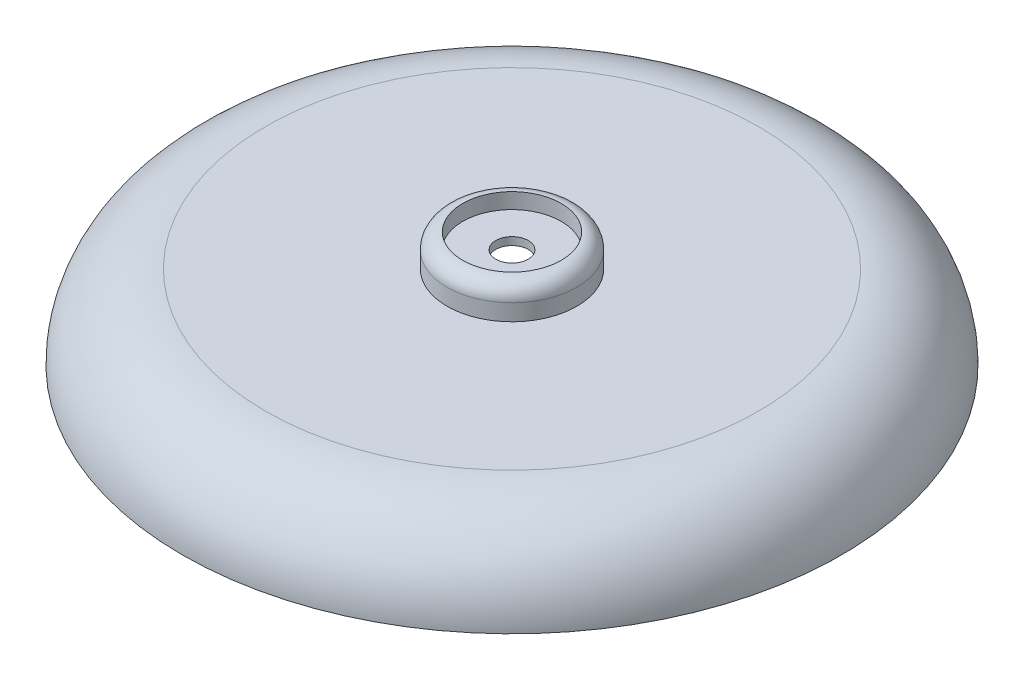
ISO-10303-21;
HEADER;
FILE_DESCRIPTION(('STEP AP214'),'2;1');
FILE_NAME('part.step','',(''),(''),'','','');
FILE_SCHEMA(('AUTOMOTIVE_DESIGN { 1 0 10303 214 1 1 1 1 }'));
ENDSEC;
DATA;
#1=APPLICATION_CONTEXT('core data for automotive mechanical design processes');
#2=APPLICATION_PROTOCOL_DEFINITION('international standard','automotive_design',2000,#1);
#3=PRODUCT_CONTEXT('',#1,'mechanical');
#4=PRODUCT('Part','Part','',(#3));
#5=PRODUCT_RELATED_PRODUCT_CATEGORY('part','',(#4));
#6=PRODUCT_DEFINITION_FORMATION('','',#4);
#7=PRODUCT_DEFINITION_CONTEXT('part definition',#1,'design');
#8=PRODUCT_DEFINITION('design','',#6,#7);
#9=PRODUCT_DEFINITION_SHAPE('','',#8);
#10=(LENGTH_UNIT() NAMED_UNIT(*) SI_UNIT(.MILLI.,.METRE.));
#11=(NAMED_UNIT(*) PLANE_ANGLE_UNIT() SI_UNIT($,.RADIAN.));
#12=(NAMED_UNIT(*) SI_UNIT($,.STERADIAN.) SOLID_ANGLE_UNIT());
#13=UNCERTAINTY_MEASURE_WITH_UNIT(LENGTH_MEASURE(1.E-05),#10,'distance_accuracy_value','');
#14=(GEOMETRIC_REPRESENTATION_CONTEXT(3) GLOBAL_UNCERTAINTY_ASSIGNED_CONTEXT((#13)) GLOBAL_UNIT_ASSIGNED_CONTEXT((#10,
#11,#12)) REPRESENTATION_CONTEXT('',''));
#15=CARTESIAN_POINT('',(0.,0.,0.));
#16=DIRECTION('',(0.,0.,1.));
#17=DIRECTION('',(1.,0.,0.));
#18=AXIS2_PLACEMENT_3D('',#15,#16,#17);
#19=CARTESIAN_POINT('',(0.,0.,0.));
#20=DIRECTION('',(0.,-1.,0.));
#21=DIRECTION('',(0.,0.,-1.));
#22=AXIS2_PLACEMENT_3D('',#19,#20,#21);
#23=CYLINDRICAL_SURFACE('',#22,3.125);
#24=CARTESIAN_POINT('',(0.,-1.5,0.));
#25=DIRECTION('',(0.,-1.,0.));
#26=DIRECTION('',(0.,0.,-1.));
#27=AXIS2_PLACEMENT_3D('',#24,#25,#26);
#28=CIRCLE('',#27,3.125);
#29=CARTESIAN_POINT('',(0.,-1.5,-3.125));
#30=VERTEX_POINT('',#29);
#31=EDGE_CURVE('E72',#30,#30,#28,.T.);
#32=ORIENTED_EDGE('',*,*,#31,.T.);
#33=EDGE_LOOP('',(#32));
#34=FACE_BOUND('',#33,.T.);
#35=CARTESIAN_POINT('',(0.,0.,0.));
#36=DIRECTION('',(0.,-1.,0.));
#37=DIRECTION('',(0.,0.,-1.));
#38=AXIS2_PLACEMENT_3D('',#35,#36,#37);
#39=CIRCLE('',#38,3.125);
#40=CARTESIAN_POINT('',(0.,0.,-3.125));
#41=VERTEX_POINT('',#40);
#42=EDGE_CURVE('E10',#41,#41,#39,.T.);
#43=ORIENTED_EDGE('',*,*,#42,.F.);
#44=EDGE_LOOP('',(#43));
#45=FACE_BOUND('',#44,.T.);
#46=ADVANCED_FACE('F32',(#34,#45),#23,.F.);
#47=CARTESIAN_POINT('',(3.125,0.,0.));
#48=DIRECTION('',(0.,1.,0.));
#49=DIRECTION('',(0.,0.,1.));
#50=AXIS2_PLACEMENT_3D('',#47,#48,#49);
#51=PLANE('',#50);
#52=ORIENTED_EDGE('',*,*,#42,.T.);
#53=EDGE_LOOP('',(#52));
#54=FACE_BOUND('',#53,.T.);
#55=CARTESIAN_POINT('',(0.,0.,0.));
#56=DIRECTION('',(0.,-1.,0.));
#57=DIRECTION('',(0.,0.,-1.));
#58=AXIS2_PLACEMENT_3D('',#55,#56,#57);
#59=CIRCLE('',#58,9.5);
#60=CARTESIAN_POINT('',(0.,0.,-9.5));
#61=VERTEX_POINT('',#60);
#62=EDGE_CURVE('E38',#61,#61,#59,.T.);
#63=ORIENTED_EDGE('',*,*,#62,.F.);
#64=EDGE_LOOP('',(#63));
#65=FACE_BOUND('',#64,.T.);
#66=ADVANCED_FACE('F90',(#54,#65),#51,.T.);
#67=CARTESIAN_POINT('',(0.,0.,0.));
#68=DIRECTION('',(0.,-1.,0.));
#69=DIRECTION('',(0.,0.,-1.));
#70=AXIS2_PLACEMENT_3D('',#67,#68,#69);
#71=CYLINDRICAL_SURFACE('',#70,9.5);
#72=ORIENTED_EDGE('',*,*,#62,.T.);
#73=EDGE_LOOP('',(#72));
#74=FACE_BOUND('',#73,.T.);
#75=CARTESIAN_POINT('',(0.,3.,0.));
#76=DIRECTION('',(0.,-1.,0.));
#77=DIRECTION('',(0.,0.,-1.));
#78=AXIS2_PLACEMENT_3D('',#75,#76,#77);
#79=CIRCLE('',#78,9.5);
#80=CARTESIAN_POINT('',(0.,3.,-9.5));
#81=VERTEX_POINT('',#80);
#82=EDGE_CURVE('E42',#81,#81,#79,.T.);
#83=ORIENTED_EDGE('',*,*,#82,.F.);
#84=EDGE_LOOP('',(#83));
#85=FACE_BOUND('',#84,.T.);
#86=ADVANCED_FACE('F94',(#74,#85),#71,.F.);
#87=CARTESIAN_POINT('',(0.,0.,0.));
#88=DIRECTION('',(0.,-1.,0.));
#89=DIRECTION('',(0.,0.,-1.));
#90=AXIS2_PLACEMENT_3D('',#87,#88,#89);
#91=TOROIDAL_SURFACE('',#90,9.5,3.);
#92=ORIENTED_EDGE('',*,*,#82,.T.);
#93=EDGE_LOOP('',(#92));
#94=FACE_BOUND('',#93,.T.);
#95=CARTESIAN_POINT('',(0.,0.,0.));
#96=DIRECTION('',(0.,-1.,0.));
#97=DIRECTION('',(0.,0.,-1.));
#98=AXIS2_PLACEMENT_3D('',#95,#96,#97);
#99=CIRCLE('',#98,12.5);
#100=CARTESIAN_POINT('',(0.,0.,-12.5));
#101=VERTEX_POINT('',#100);
#102=EDGE_CURVE('E46',#101,#101,#99,.T.);
#103=ORIENTED_EDGE('',*,*,#102,.F.);
#104=EDGE_LOOP('',(#103));
#105=FACE_BOUND('',#104,.T.);
#106=ADVANCED_FACE('F98',(#94,#105),#91,.T.);
#107=CARTESIAN_POINT('',(0.,0.,0.));
#108=DIRECTION('',(0.,-1.,0.));
#109=DIRECTION('',(0.,0.,-1.));
#110=AXIS2_PLACEMENT_3D('',#107,#108,#109);
#111=CYLINDRICAL_SURFACE('',#110,12.5);
#112=ORIENTED_EDGE('',*,*,#102,.T.);
#113=EDGE_LOOP('',(#112));
#114=FACE_BOUND('',#113,.T.);
#115=CARTESIAN_POINT('',(0.,-3.175,0.));
#116=DIRECTION('',(0.,-1.,0.));
#117=DIRECTION('',(0.,0.,-1.));
#118=AXIS2_PLACEMENT_3D('',#115,#116,#117);
#119=CIRCLE('',#118,12.5);
#120=CARTESIAN_POINT('',(0.,-3.175,-12.5));
#121=VERTEX_POINT('',#120);
#122=EDGE_CURVE('E51',#121,#121,#119,.T.);
#123=ORIENTED_EDGE('',*,*,#122,.F.);
#124=EDGE_LOOP('',(#123));
#125=FACE_BOUND('',#124,.T.);
#126=ADVANCED_FACE('F104',(#114,#125),#111,.T.);
#127=CARTESIAN_POINT('',(12.5,-3.175,0.));
#128=DIRECTION('',(0.,1.,0.));
#129=DIRECTION('',(0.,0.,1.));
#130=AXIS2_PLACEMENT_3D('',#127,#128,#129);
#131=PLANE('',#130);
#132=ORIENTED_EDGE('',*,*,#122,.T.);
#133=EDGE_LOOP('',(#132));
#134=FACE_BOUND('',#133,.T.);
#135=CARTESIAN_POINT('',(0.,-3.175,0.));
#136=DIRECTION('',(0.,-1.,0.));
#137=DIRECTION('',(0.,0.,-1.));
#138=AXIS2_PLACEMENT_3D('',#135,#136,#137);
#139=CIRCLE('',#138,47.5);
#140=CARTESIAN_POINT('',(0.,-3.175,-47.5));
#141=VERTEX_POINT('',#140);
#142=EDGE_CURVE('E54',#141,#141,#139,.T.);
#143=ORIENTED_EDGE('',*,*,#142,.F.);
#144=EDGE_LOOP('',(#143));
#145=FACE_BOUND('',#144,.T.);
#146=ADVANCED_FACE('F108',(#134,#145),#131,.T.);
#147=CARTESIAN_POINT('',(0.,-19.175,0.));
#148=DIRECTION('',(0.,-1.,0.));
#149=DIRECTION('',(0.,0.,-1.));
#150=AXIS2_PLACEMENT_3D('',#147,#148,#149);
#151=TOROIDAL_SURFACE('',#150,47.5,16.);
#152=ORIENTED_EDGE('',*,*,#142,.T.);
#153=EDGE_LOOP('',(#152));
#154=FACE_BOUND('',#153,.T.);
#155=CARTESIAN_POINT('',(0.,-19.175,0.));
#156=DIRECTION('',(0.,-1.,0.));
#157=DIRECTION('',(0.,0.,-1.));
#158=AXIS2_PLACEMENT_3D('',#155,#156,#157);
#159=CIRCLE('',#158,63.5);
#160=CARTESIAN_POINT('',(0.,-19.175,-63.5));
#161=VERTEX_POINT('',#160);
#162=EDGE_CURVE('E57',#161,#161,#159,.T.);
#163=ORIENTED_EDGE('',*,*,#162,.F.);
#164=EDGE_LOOP('',(#163));
#165=FACE_BOUND('',#164,.T.);
#166=ADVANCED_FACE('F112',(#154,#165),#151,.T.);
#167=CARTESIAN_POINT('',(63.5,-19.175,0.));
#168=DIRECTION('',(0.,-1.,0.));
#169=DIRECTION('',(0.,0.,-1.));
#170=AXIS2_PLACEMENT_3D('',#167,#168,#169);
#171=PLANE('',#170);
#172=ORIENTED_EDGE('',*,*,#162,.T.);
#173=EDGE_LOOP('',(#172));
#174=FACE_BOUND('',#173,.T.);
#175=CARTESIAN_POINT('',(0.,-19.175,0.));
#176=DIRECTION('',(0.,-1.,0.));
#177=DIRECTION('',(0.,0.,-1.));
#178=AXIS2_PLACEMENT_3D('',#175,#176,#177);
#179=CIRCLE('',#178,62.);
#180=CARTESIAN_POINT('',(0.,-19.175,-62.));
#181=VERTEX_POINT('',#180);
#182=EDGE_CURVE('E60',#181,#181,#179,.T.);
#183=ORIENTED_EDGE('',*,*,#182,.F.);
#184=EDGE_LOOP('',(#183));
#185=FACE_BOUND('',#184,.T.);
#186=ADVANCED_FACE('F116',(#174,#185),#171,.T.);
#187=CARTESIAN_POINT('',(0.,-19.175,0.));
#188=DIRECTION('',(0.,-1.,0.));
#189=DIRECTION('',(0.,0.,-1.));
#190=AXIS2_PLACEMENT_3D('',#187,#188,#189);
#191=TOROIDAL_SURFACE('',#190,47.5,14.5);
#192=ORIENTED_EDGE('',*,*,#182,.T.);
#193=EDGE_LOOP('',(#192));
#194=FACE_BOUND('',#193,.T.);
#195=CARTESIAN_POINT('',(0.,-4.675,0.));
#196=DIRECTION('',(0.,-1.,0.));
#197=DIRECTION('',(0.,0.,-1.));
#198=AXIS2_PLACEMENT_3D('',#195,#196,#197);
#199=CIRCLE('',#198,47.5);
#200=CARTESIAN_POINT('',(0.,-4.675,-47.5));
#201=VERTEX_POINT('',#200);
#202=EDGE_CURVE('E63',#201,#201,#199,.T.);
#203=ORIENTED_EDGE('',*,*,#202,.F.);
#204=EDGE_LOOP('',(#203));
#205=FACE_BOUND('',#204,.T.);
#206=ADVANCED_FACE('F120',(#194,#205),#191,.F.);
#207=CARTESIAN_POINT('',(11.,-4.675,0.));
#208=DIRECTION('',(0.,-1.,0.));
#209=DIRECTION('',(0.,0.,-1.));
#210=AXIS2_PLACEMENT_3D('',#207,#208,#209);
#211=PLANE('',#210);
#212=ORIENTED_EDGE('',*,*,#202,.T.);
#213=EDGE_LOOP('',(#212));
#214=FACE_BOUND('',#213,.T.);
#215=CARTESIAN_POINT('',(0.,-4.675,0.));
#216=DIRECTION('',(0.,-1.,0.));
#217=DIRECTION('',(0.,0.,-1.));
#218=AXIS2_PLACEMENT_3D('',#215,#216,#217);
#219=CIRCLE('',#218,11.);
#220=CARTESIAN_POINT('',(0.,-4.675,-11.));
#221=VERTEX_POINT('',#220);
#222=EDGE_CURVE('E66',#221,#221,#219,.T.);
#223=ORIENTED_EDGE('',*,*,#222,.F.);
#224=EDGE_LOOP('',(#223));
#225=FACE_BOUND('',#224,.T.);
#226=ADVANCED_FACE('F86',(#214,#225),#211,.T.);
#227=CARTESIAN_POINT('',(0.,0.,0.));
#228=DIRECTION('',(0.,-1.,0.));
#229=DIRECTION('',(0.,0.,-1.));
#230=AXIS2_PLACEMENT_3D('',#227,#228,#229);
#231=CYLINDRICAL_SURFACE('',#230,11.);
#232=ORIENTED_EDGE('',*,*,#222,.T.);
#233=EDGE_LOOP('',(#232));
#234=FACE_BOUND('',#233,.T.);
#235=CARTESIAN_POINT('',(0.,-1.5,0.));
#236=DIRECTION('',(0.,-1.,0.));
#237=DIRECTION('',(0.,0.,-1.));
#238=AXIS2_PLACEMENT_3D('',#235,#236,#237);
#239=CIRCLE('',#238,11.);
#240=CARTESIAN_POINT('',(0.,-1.5,-11.));
#241=VERTEX_POINT('',#240);
#242=EDGE_CURVE('E69',#241,#241,#239,.T.);
#243=ORIENTED_EDGE('',*,*,#242,.F.);
#244=EDGE_LOOP('',(#243));
#245=FACE_BOUND('',#244,.T.);
#246=ADVANCED_FACE('F80',(#234,#245),#231,.F.);
#247=CARTESIAN_POINT('',(3.125,-1.5,0.));
#248=DIRECTION('',(0.,-1.,0.));
#249=DIRECTION('',(0.,0.,-1.));
#250=AXIS2_PLACEMENT_3D('',#247,#248,#249);
#251=PLANE('',#250);
#252=ORIENTED_EDGE('',*,*,#242,.T.);
#253=EDGE_LOOP('',(#252));
#254=FACE_BOUND('',#253,.T.);
#255=ORIENTED_EDGE('',*,*,#31,.F.);
#256=EDGE_LOOP('',(#255));
#257=FACE_BOUND('',#256,.T.);
#258=ADVANCED_FACE('F78',(#254,#257),#251,.T.);
#259=CLOSED_SHELL('',(#46,#66,#86,#106,#126,#146,#166,#186,#206,#226,#246,#258));
#260=MANIFOLD_SOLID_BREP('B2',#259);
#261=ADVANCED_BREP_SHAPE_REPRESENTATION('',(#18,#260),#14);
#262=SHAPE_DEFINITION_REPRESENTATION(#9,#261);
ENDSEC;
END-ISO-10303-21;
